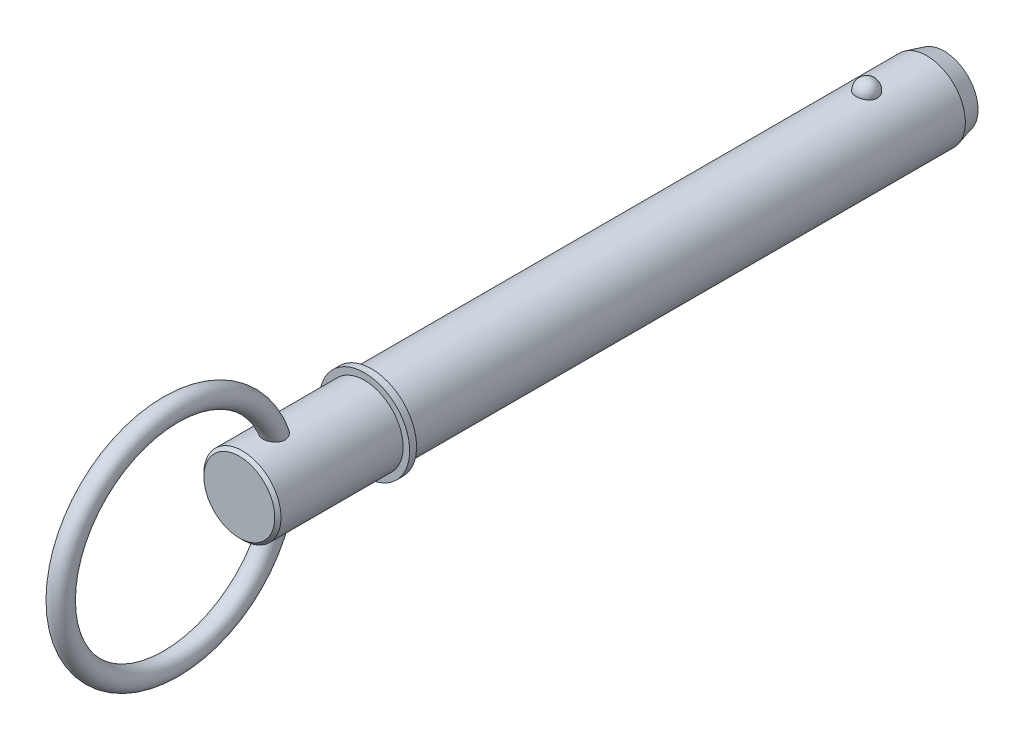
ISO-10303-21;
HEADER;
FILE_DESCRIPTION(('STEP AP214'),'2;1');
FILE_NAME('part.step','',(''),(''),'','','');
FILE_SCHEMA(('AUTOMOTIVE_DESIGN { 1 0 10303 214 1 1 1 1 }'));
ENDSEC;
DATA;
#1=APPLICATION_CONTEXT('core data for automotive mechanical design processes');
#2=APPLICATION_PROTOCOL_DEFINITION('international standard','automotive_design',2000,#1);
#3=PRODUCT_CONTEXT('',#1,'mechanical');
#4=PRODUCT('Part','Part','',(#3));
#5=PRODUCT_RELATED_PRODUCT_CATEGORY('part','',(#4));
#6=PRODUCT_DEFINITION_FORMATION('','',#4);
#7=PRODUCT_DEFINITION_CONTEXT('part definition',#1,'design');
#8=PRODUCT_DEFINITION('design','',#6,#7);
#9=PRODUCT_DEFINITION_SHAPE('','',#8);
#10=(LENGTH_UNIT() NAMED_UNIT(*) SI_UNIT(.MILLI.,.METRE.));
#11=(NAMED_UNIT(*) PLANE_ANGLE_UNIT() SI_UNIT($,.RADIAN.));
#12=(NAMED_UNIT(*) SI_UNIT($,.STERADIAN.) SOLID_ANGLE_UNIT());
#13=UNCERTAINTY_MEASURE_WITH_UNIT(LENGTH_MEASURE(1.E-05),#10,'distance_accuracy_value','');
#14=(GEOMETRIC_REPRESENTATION_CONTEXT(3) GLOBAL_UNCERTAINTY_ASSIGNED_CONTEXT((#13)) GLOBAL_UNIT_ASSIGNED_CONTEXT((#10,
#11,#12)) REPRESENTATION_CONTEXT('',''));
#15=CARTESIAN_POINT('',(0.,0.,0.));
#16=DIRECTION('',(0.,0.,1.));
#17=DIRECTION('',(1.,0.,0.));
#18=AXIS2_PLACEMENT_3D('',#15,#16,#17);
#19=CARTESIAN_POINT('',(0.,0.,139.7));
#20=DIRECTION('',(0.,0.,-1.));
#21=DIRECTION('',(-1.,0.,0.));
#22=AXIS2_PLACEMENT_3D('',#19,#20,#21);
#23=CYLINDRICAL_SURFACE('',#22,11.115);
#24=CARTESIAN_POINT('',(3.04058343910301,10.6910278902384,-3.07));
#25=CARTESIAN_POINT('',(3.04058039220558,10.6910304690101,-2.89837124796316));
#26=CARTESIAN_POINT('',(3.02657193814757,10.6950430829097,-2.72670368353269));
#27=CARTESIAN_POINT('',(2.97087341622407,10.7106465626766,-2.38822964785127));
#28=CARTESIAN_POINT('',(2.92917240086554,10.7222404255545,-2.22142512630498));
#29=CARTESIAN_POINT('',(2.81915317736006,10.751689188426,-1.89750816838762));
#30=CARTESIAN_POINT('',(2.75084669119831,10.7695413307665,-1.7403914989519));
#31=CARTESIAN_POINT('',(2.58932284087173,10.809510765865,-1.44013959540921));
#32=CARTESIAN_POINT('',(2.49610617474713,10.8316279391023,-1.29700396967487));
#33=CARTESIAN_POINT('',(2.28659317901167,10.877786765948,-1.02797591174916));
#34=CARTESIAN_POINT('',(2.17018825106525,10.9018371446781,-0.902169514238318));
#35=CARTESIAN_POINT('',(1.91759004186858,10.9490888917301,-0.672091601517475));
#36=CARTESIAN_POINT('',(1.78139672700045,10.9722902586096,-0.567820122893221));
#37=CARTESIAN_POINT('',(1.49327884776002,11.0151925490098,-0.383992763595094));
#38=CARTESIAN_POINT('',(1.34139928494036,11.034903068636,-0.30436866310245));
#39=CARTESIAN_POINT('',(1.02584823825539,11.0686948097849,-0.171731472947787));
#40=CARTESIAN_POINT('',(0.86217801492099,11.0827766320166,-0.118715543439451));
#41=CARTESIAN_POINT('',(0.530748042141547,11.1035404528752,-0.0415304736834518));
#42=CARTESIAN_POINT('',(0.363109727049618,11.1103474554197,-0.0168734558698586));
#43=CARTESIAN_POINT('',(0.0259327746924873,11.1162480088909,0.00453486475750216));
#44=CARTESIAN_POINT('',(-0.143605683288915,11.1153422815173,0.00128877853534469));
#45=CARTESIAN_POINT('',(-0.477280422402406,11.1059854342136,-0.0327676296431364));
#46=CARTESIAN_POINT('',(-0.641459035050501,11.0976393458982,-0.0631942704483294));
#47=CARTESIAN_POINT('',(-0.962236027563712,11.0744390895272,-0.150220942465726));
#48=CARTESIAN_POINT('',(-1.11883427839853,11.0595848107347,-0.20682141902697));
#49=CARTESIAN_POINT('',(-1.4210461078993,11.0248420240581,-0.345028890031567));
#50=CARTESIAN_POINT('',(-1.56659244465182,11.0049254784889,-0.426775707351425));
#51=CARTESIAN_POINT('',(-1.84189316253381,10.9622119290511,-0.612956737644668));
#52=CARTESIAN_POINT('',(-1.97164597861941,10.9394146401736,-0.71739319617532));
#53=CARTESIAN_POINT('',(-2.21432263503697,10.8929139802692,-0.948332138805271));
#54=CARTESIAN_POINT('',(-2.3268890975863,10.8692016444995,-1.07520847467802));
#55=CARTESIAN_POINT('',(-2.52940007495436,10.8238699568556,-1.34622145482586));
#56=CARTESIAN_POINT('',(-2.6193430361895,10.8022507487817,-1.49035928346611));
#57=CARTESIAN_POINT('',(-2.77523958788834,10.7632629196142,-1.79367507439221));
#58=CARTESIAN_POINT('',(-2.8409151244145,10.7459442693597,-1.95300253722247));
#59=CARTESIAN_POINT('',(-2.94519180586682,10.7178360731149,-2.28083009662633));
#60=CARTESIAN_POINT('',(-2.98379371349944,10.707046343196,-2.44932993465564));
#61=CARTESIAN_POINT('',(-3.03284665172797,10.6932559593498,-2.78998091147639));
#62=CARTESIAN_POINT('',(-3.04341313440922,10.6902233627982,-2.96211412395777));
#63=CARTESIAN_POINT('',(-3.03646037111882,10.6922002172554,-3.305762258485));
#64=CARTESIAN_POINT('',(-3.0189418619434,10.6972094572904,-3.47727719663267));
#65=CARTESIAN_POINT('',(-2.95641582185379,10.7146564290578,-3.81396465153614));
#66=CARTESIAN_POINT('',(-2.91154117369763,10.7270582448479,-3.97916375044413));
#67=CARTESIAN_POINT('',(-2.79553341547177,10.7578713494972,-4.29947360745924));
#68=CARTESIAN_POINT('',(-2.72439927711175,10.7762828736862,-4.45458397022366));
#69=CARTESIAN_POINT('',(-2.55718900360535,10.8171819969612,-4.75123550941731));
#70=CARTESIAN_POINT('',(-2.46098224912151,10.8396907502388,-4.89270014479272));
#71=CARTESIAN_POINT('',(-2.24623042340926,10.8862165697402,-5.15724095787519));
#72=CARTESIAN_POINT('',(-2.12768452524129,10.9102336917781,-5.28031645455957));
#73=CARTESIAN_POINT('',(-1.87085107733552,10.9571990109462,-5.5050961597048));
#74=CARTESIAN_POINT('',(-1.73249451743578,10.9801430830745,-5.60672245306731));
#75=CARTESIAN_POINT('',(-1.44010079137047,11.0223008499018,-5.78517789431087));
#76=CARTESIAN_POINT('',(-1.28606470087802,11.0415148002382,-5.86200874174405));
#77=CARTESIAN_POINT('',(-0.968615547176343,11.0738491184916,-5.98788441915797));
#78=CARTESIAN_POINT('',(-0.805339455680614,11.0870408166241,-6.03725610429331));
#79=CARTESIAN_POINT('',(-0.47244987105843,11.1062048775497,-6.10820004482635));
#80=CARTESIAN_POINT('',(-0.302837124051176,11.11217808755,-6.1297755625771));
#81=CARTESIAN_POINT('',(0.0345765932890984,11.1162034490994,-6.14436196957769));
#82=CARTESIAN_POINT('',(0.20235372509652,11.1143988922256,-6.13788957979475));
#83=CARTESIAN_POINT('',(0.534364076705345,11.103390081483,-6.09773981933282));
#84=CARTESIAN_POINT('',(0.698597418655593,11.094186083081,-6.06406338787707));
#85=CARTESIAN_POINT('',(1.01830314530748,11.0694136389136,-5.97063285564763));
#86=CARTESIAN_POINT('',(1.17380497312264,11.0538682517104,-5.91097318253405));
#87=CARTESIAN_POINT('',(1.472484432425,11.0180608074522,-5.76723645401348));
#88=CARTESIAN_POINT('',(1.6156613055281,10.9977984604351,-5.68315789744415));
#89=CARTESIAN_POINT('',(1.88801614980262,10.9543574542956,-5.49138807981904));
#90=CARTESIAN_POINT('',(2.01695079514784,10.9311394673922,-5.38336024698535));
#91=CARTESIAN_POINT('',(2.25501495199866,10.8845248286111,-5.14733839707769));
#92=CARTESIAN_POINT('',(2.36414099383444,10.8611281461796,-5.01934088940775));
#93=CARTESIAN_POINT('',(2.56152595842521,10.8162958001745,-4.74447932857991));
#94=CARTESIAN_POINT('',(2.64940088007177,10.7948999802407,-4.59733288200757));
#95=CARTESIAN_POINT('',(2.79961494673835,10.7569242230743,-4.29001203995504));
#96=CARTESIAN_POINT('',(2.86196390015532,10.7403424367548,-4.12984267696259));
#97=CARTESIAN_POINT('',(2.95377333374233,10.715429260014,-3.820623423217));
#98=CARTESIAN_POINT('',(2.98627018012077,10.7063495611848,-3.6725268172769));
#99=CARTESIAN_POINT('',(3.02967634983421,10.6941478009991,-3.37296350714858));
#100=CARTESIAN_POINT('',(3.04058612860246,10.6910256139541,-3.22149687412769));
#101=CARTESIAN_POINT('',(3.04058343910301,10.6910278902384,-3.07));
#102=B_SPLINE_CURVE_WITH_KNOTS('',3,(#24,#25,#26,#27,#28,#29,#30,#31,#32,#33,#34,#35,#36,#37,
#38,#39,#40,#41,#42,#43,#44,#45,#46,#47,#48,#49,#50,#51,#52,#53,#54,#55,#56,#57,#58,#59,#60,#61,
#62,#63,#64,#65,#66,#67,#68,#69,#70,#71,#72,#73,#74,#75,#76,#77,#78,#79,#80,#81,#82,#83,#84,#85,
#86,#87,#88,#89,#90,#91,#92,#93,#94,#95,#96,#97,#98,#99,#100,#101),.UNSPECIFIED.,.T.,.F.,(4,2,2,
2,2,2,2,2,2,2,2,2,2,2,2,2,2,2,2,2,2,2,2,2,2,2,2,2,2,2,2,2,2,2,2,2,2,2,4),(0.,0.514341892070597,
1.02888723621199,1.54320613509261,2.0575106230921,2.57428293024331,3.09105611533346,
3.60638589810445,4.1216606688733,4.62793159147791,5.1341551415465,5.63334381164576,
6.13254097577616,6.63456562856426,7.13663998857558,7.64804063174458,8.15947638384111,
8.6766026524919,9.19371435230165,9.70869321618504,10.223658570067,10.7361421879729,
11.2486458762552,11.7638748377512,12.2791228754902,12.7962115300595,13.3132647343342,
13.8240238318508,14.3347229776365,14.8360540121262,15.3373677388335,15.8368746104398,
16.3364121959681,16.8434736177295,17.3506237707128,17.8663484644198,18.3818748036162,
18.8358944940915,19.2899046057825),.UNSPECIFIED.);
#103=CARTESIAN_POINT('',(3.04058343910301,10.6910278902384,-3.07));
#104=VERTEX_POINT('',#103);
#105=EDGE_CURVE('E102',#104,#104,#102,.T.);
#106=ORIENTED_EDGE('',*,*,#105,.T.);
#107=EDGE_LOOP('',(#106));
#108=FACE_BOUND('',#107,.T.);
#109=CARTESIAN_POINT('',(0.,0.,-20.3999999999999));
#110=DIRECTION('',(0.,0.,-1.));
#111=DIRECTION('',(-1.,0.,0.));
#112=AXIS2_PLACEMENT_3D('',#109,#110,#111);
#113=CIRCLE('',#112,11.115);
#114=CARTESIAN_POINT('',(-11.115,0.,-20.3999999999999));
#115=VERTEX_POINT('',#114);
#116=EDGE_CURVE('E110',#115,#115,#113,.F.);
#117=ORIENTED_EDGE('',*,*,#116,.T.);
#118=EDGE_LOOP('',(#117));
#119=FACE_BOUND('',#118,.T.);
#120=CARTESIAN_POINT('',(0.,0.,139.7));
#121=DIRECTION('',(0.,0.,1.));
#122=DIRECTION('',(1.,0.,0.));
#123=AXIS2_PLACEMENT_3D('',#120,#121,#122);
#124=CIRCLE('',#123,11.115);
#125=CARTESIAN_POINT('',(11.115,0.,139.7));
#126=VERTEX_POINT('',#125);
#127=EDGE_CURVE('E108',#126,#126,#124,.T.);
#128=ORIENTED_EDGE('',*,*,#127,.F.);
#129=EDGE_LOOP('',(#128));
#130=FACE_BOUND('',#129,.T.);
#131=ADVANCED_FACE('F39',(#108,#119,#130),#23,.T.);
#132=CARTESIAN_POINT('',(0.,0.,-25.4));
#133=DIRECTION('',(0.,0.,-1.));
#134=DIRECTION('',(-1.,0.,0.));
#135=AXIS2_PLACEMENT_3D('',#132,#133,#134);
#136=PLANE('',#135);
#137=CARTESIAN_POINT('',(0.,0.,-25.4));
#138=DIRECTION('',(0.,0.,-1.));
#139=DIRECTION('',(-1.,0.,0.));
#140=AXIS2_PLACEMENT_3D('',#137,#138,#139);
#141=CIRCLE('',#140,9.77525403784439);
#142=CARTESIAN_POINT('',(-9.77525403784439,0.,-25.4));
#143=VERTEX_POINT('',#142);
#144=EDGE_CURVE('E141',#143,#143,#141,.T.);
#145=ORIENTED_EDGE('',*,*,#144,.T.);
#146=EDGE_LOOP('',(#145));
#147=FACE_BOUND('',#146,.T.);
#148=ADVANCED_FACE('F88',(#147),#136,.T.);
#149=CARTESIAN_POINT('',(0.,0.,-25.4));
#150=DIRECTION('',(0.,0.,1.));
#151=DIRECTION('',(1.,0.,0.));
#152=AXIS2_PLACEMENT_3D('',#149,#150,#151);
#153=CONICAL_SURFACE('',#152,9.77525403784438,0.261799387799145);
#154=ORIENTED_EDGE('',*,*,#116,.F.);
#155=EDGE_LOOP('',(#154));
#156=FACE_BOUND('',#155,.T.);
#157=ORIENTED_EDGE('',*,*,#144,.F.);
#158=EDGE_LOOP('',(#157));
#159=FACE_BOUND('',#158,.T.);
#160=ADVANCED_FACE('F94',(#156,#159),#153,.T.);
#161=CARTESIAN_POINT('',(0.,11.115,-3.07));
#162=DIRECTION('',(0.,1.,0.));
#163=DIRECTION('',(0.,0.,1.));
#164=AXIS2_PLACEMENT_3D('',#161,#162,#163);
#165=SPHERICAL_SURFACE('',#164,3.07);
#166=ORIENTED_EDGE('',*,*,#105,.F.);
#167=EDGE_LOOP('',(#166));
#168=FACE_BOUND('',#167,.T.);
#169=ADVANCED_FACE('F113',(#168),#165,.T.);
#170=CARTESIAN_POINT('',(0.,0.,139.7));
#171=DIRECTION('',(0.,0.,-1.));
#172=DIRECTION('',(-1.,0.,0.));
#173=AXIS2_PLACEMENT_3D('',#170,#171,#172);
#174=PLANE('',#173);
#175=ORIENTED_EDGE('',*,*,#127,.T.);
#176=EDGE_LOOP('',(#175));
#177=FACE_BOUND('',#176,.T.);
#178=CARTESIAN_POINT('',(0.,0.,139.7));
#179=DIRECTION('',(0.,0.,-1.));
#180=DIRECTION('',(-1.,0.,0.));
#181=AXIS2_PLACEMENT_3D('',#178,#179,#180);
#182=CIRCLE('',#181,13.);
#183=CARTESIAN_POINT('',(-13.,0.,139.7));
#184=VERTEX_POINT('',#183);
#185=EDGE_CURVE('E109',#184,#184,#182,.T.);
#186=ORIENTED_EDGE('',*,*,#185,.T.);
#187=EDGE_LOOP('',(#186));
#188=FACE_BOUND('',#187,.T.);
#189=ADVANCED_FACE('F117',(#177,#188),#174,.T.);
#190=CARTESIAN_POINT('',(0.,0.,33.7287874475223));
#191=DIRECTION('',(0.,0.,-1.));
#192=DIRECTION('',(-1.,0.,0.));
#193=AXIS2_PLACEMENT_3D('',#190,#191,#192);
#194=CYLINDRICAL_SURFACE('',#193,13.);
#195=CARTESIAN_POINT('',(0.,0.,141.7));
#196=DIRECTION('',(0.,0.,-1.));
#197=DIRECTION('',(-1.,0.,0.));
#198=AXIS2_PLACEMENT_3D('',#195,#196,#197);
#199=CIRCLE('',#198,13.);
#200=CARTESIAN_POINT('',(-13.,0.,141.7));
#201=VERTEX_POINT('',#200);
#202=EDGE_CURVE('E134',#201,#201,#199,.T.);
#203=ORIENTED_EDGE('',*,*,#202,.T.);
#204=EDGE_LOOP('',(#203));
#205=FACE_BOUND('',#204,.T.);
#206=ORIENTED_EDGE('',*,*,#185,.F.);
#207=EDGE_LOOP('',(#206));
#208=FACE_BOUND('',#207,.T.);
#209=ADVANCED_FACE('F121',(#205,#208),#194,.T.);
#210=CARTESIAN_POINT('',(0.,13.,141.7));
#211=DIRECTION('',(0.,0.,1.));
#212=DIRECTION('',(1.,0.,0.));
#213=AXIS2_PLACEMENT_3D('',#210,#211,#212);
#214=PLANE('',#213);
#215=CARTESIAN_POINT('',(0.,0.,141.7));
#216=DIRECTION('',(0.,0.,1.));
#217=DIRECTION('',(1.,0.,0.));
#218=AXIS2_PLACEMENT_3D('',#215,#216,#217);
#219=CIRCLE('',#218,11.115);
#220=CARTESIAN_POINT('',(11.115,0.,141.7));
#221=VERTEX_POINT('',#220);
#222=EDGE_CURVE('E112',#221,#221,#219,.T.);
#223=ORIENTED_EDGE('',*,*,#222,.F.);
#224=EDGE_LOOP('',(#223));
#225=FACE_BOUND('',#224,.T.);
#226=ORIENTED_EDGE('',*,*,#202,.F.);
#227=EDGE_LOOP('',(#226));
#228=FACE_BOUND('',#227,.T.);
#229=ADVANCED_FACE('F85',(#225,#228),#214,.T.);
#230=CARTESIAN_POINT('',(0.,0.,177.8));
#231=DIRECTION('',(0.,0.,-1.));
#232=DIRECTION('',(-1.,0.,0.));
#233=AXIS2_PLACEMENT_3D('',#230,#231,#232);
#234=CYLINDRICAL_SURFACE('',#233,11.115);
#235=CARTESIAN_POINT('',(-1.22435852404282,-11.0473603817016,164.878419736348));
#236=CARTESIAN_POINT('',(-1.0707801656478,-11.0643805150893,164.811699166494));
#237=CARTESIAN_POINT('',(-0.911372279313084,-11.0787777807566,164.757745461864));
#238=CARTESIAN_POINT('',(-0.585451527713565,-11.1007717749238,164.676552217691));
#239=CARTESIAN_POINT('',(-0.418938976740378,-11.1083688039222,164.649311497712));
#240=CARTESIAN_POINT('',(-0.0835394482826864,-11.1159515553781,164.622121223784));
#241=CARTESIAN_POINT('',(0.0853474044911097,-11.1159376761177,164.622170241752));
#242=CARTESIAN_POINT('',(0.420723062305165,-11.1083011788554,164.649554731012));
#243=CARTESIAN_POINT('',(0.58721183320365,-11.1006784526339,164.676890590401));
#244=CARTESIAN_POINT('',(0.913189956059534,-11.0786293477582,164.75829957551));
#245=CARTESIAN_POINT('',(1.07267378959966,-11.0641977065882,164.812393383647));
#246=CARTESIAN_POINT('',(1.3799404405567,-11.0300907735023,164.946140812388));
#247=CARTESIAN_POINT('',(1.52772335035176,-11.0104155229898,165.025794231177));
#248=CARTESIAN_POINT('',(1.80679367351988,-10.9680716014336,165.208467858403));
#249=CARTESIAN_POINT('',(1.93814041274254,-10.945414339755,165.311400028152));
#250=CARTESIAN_POINT('',(2.18117403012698,-10.8995884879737,165.538212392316));
#251=CARTESIAN_POINT('',(2.29286356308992,-10.8764199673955,165.662089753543));
#252=CARTESIAN_POINT('',(2.49238969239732,-10.8324319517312,165.925992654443));
#253=CARTESIAN_POINT('',(2.58046870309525,-10.8115899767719,166.065831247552));
#254=CARTESIAN_POINT('',(2.73218762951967,-10.7742522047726,166.358691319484));
#255=CARTESIAN_POINT('',(2.7958294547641,-10.757756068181,166.511711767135));
#256=CARTESIAN_POINT('',(2.89767977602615,-10.7307723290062,166.8266092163));
#257=CARTESIAN_POINT('',(2.93586554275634,-10.7202900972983,166.988493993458));
#258=CARTESIAN_POINT('',(2.98678800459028,-10.7062139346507,167.316480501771));
#259=CARTESIAN_POINT('',(2.99951894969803,-10.7026215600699,167.482583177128));
#260=CARTESIAN_POINT('',(3.0004780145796,-10.7023530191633,167.823227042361));
#261=CARTESIAN_POINT('',(2.98743421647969,-10.7060358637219,167.997770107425));
#262=CARTESIAN_POINT('',(2.93592917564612,-10.7202719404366,168.342750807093));
#263=CARTESIAN_POINT('',(2.8974582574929,-10.7308277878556,168.513186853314));
#264=CARTESIAN_POINT('',(2.79180512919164,-10.7588257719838,168.863114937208));
#265=CARTESIAN_POINT('',(2.72213928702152,-10.776850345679,169.041811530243));
#266=CARTESIAN_POINT('',(2.5561284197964,-10.8174264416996,169.385974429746));
#267=CARTESIAN_POINT('',(2.4597569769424,-10.8399824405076,169.551427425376));
#268=CARTESIAN_POINT('',(2.23434632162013,-10.8887625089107,169.875672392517));
#269=CARTESIAN_POINT('',(2.10349593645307,-10.9151327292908,170.033192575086));
#270=CARTESIAN_POINT('',(1.81505097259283,-10.96677510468,170.321668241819));
#271=CARTESIAN_POINT('',(1.65749731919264,-10.9920488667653,170.45266371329));
#272=CARTESIAN_POINT('',(1.36197799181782,-11.0319737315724,170.651313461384));
#273=CARTESIAN_POINT('',(1.22927684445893,-11.0476896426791,170.72660092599));
#274=CARTESIAN_POINT('',(0.952979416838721,-11.0749380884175,170.854574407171));
#275=CARTESIAN_POINT('',(0.809393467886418,-11.0864745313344,170.90728154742));
#276=CARTESIAN_POINT('',(0.513954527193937,-11.1041011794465,170.987058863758));
#277=CARTESIAN_POINT('',(0.362058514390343,-11.1101594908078,171.013978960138));
#278=CARTESIAN_POINT('',(0.0557792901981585,-11.1159132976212,171.039559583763));
#279=CARTESIAN_POINT('',(-0.0986030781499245,-11.1156109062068,171.038229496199));
#280=CARTESIAN_POINT('',(-0.389768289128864,-11.1090283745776,171.008935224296));
#281=CARTESIAN_POINT('',(-0.526830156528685,-11.1033186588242,170.983512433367));
#282=CARTESIAN_POINT('',(-0.794878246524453,-11.0873547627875,170.911270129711));
#283=CARTESIAN_POINT('',(-0.925863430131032,-11.0770998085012,170.864446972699));
#284=CARTESIAN_POINT('',(-1.18354406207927,-11.0525934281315,170.749843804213));
#285=CARTESIAN_POINT('',(-1.30991621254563,-11.0382116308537,170.681371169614));
#286=CARTESIAN_POINT('',(-1.55122352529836,-11.0068962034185,170.527131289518));
#287=CARTESIAN_POINT('',(-1.66615377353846,-10.9899614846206,170.441356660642));
#288=CARTESIAN_POINT('',(-1.90024050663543,-10.9520991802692,170.24087205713));
#289=CARTESIAN_POINT('',(-2.01728342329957,-10.9309598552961,170.123737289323));
#290=CARTESIAN_POINT('',(-2.23333659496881,-10.8888735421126,169.873839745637));
#291=CARTESIAN_POINT('',(-2.33233396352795,-10.8679267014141,169.741065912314));
#292=CARTESIAN_POINT('',(-2.52607041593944,-10.8246766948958,169.440000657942));
#293=CARTESIAN_POINT('',(-2.61741570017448,-10.8027194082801,169.269462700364));
#294=CARTESIAN_POINT('',(-2.77251687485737,-10.7639568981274,168.915671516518));
#295=CARTESIAN_POINT('',(-2.83625783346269,-10.7471544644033,168.732411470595));
#296=CARTESIAN_POINT('',(-2.93668505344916,-10.7201706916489,168.346624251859));
#297=CARTESIAN_POINT('',(-2.97161961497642,-10.7104219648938,168.143594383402));
#298=CARTESIAN_POINT('',(-2.99683495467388,-10.7033740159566,167.836874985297));
#299=CARTESIAN_POINT('',(-3.00070536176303,-10.7022882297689,167.734234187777));
#300=CARTESIAN_POINT('',(-2.99908594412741,-10.7027439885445,167.529049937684));
#301=CARTESIAN_POINT('',(-2.99360154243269,-10.7042840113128,167.426506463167));
#302=CARTESIAN_POINT('',(-2.97382504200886,-10.7097936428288,167.230330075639));
#303=CARTESIAN_POINT('',(-2.9602439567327,-10.7135669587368,167.136619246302));
#304=CARTESIAN_POINT('',(-2.92480741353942,-10.723295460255,166.950932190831));
#305=CARTESIAN_POINT('',(-2.90295619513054,-10.7292495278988,166.85895510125));
#306=CARTESIAN_POINT('',(-2.85097003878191,-10.7431800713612,166.677547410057));
#307=CARTESIAN_POINT('',(-2.82083748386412,-10.7511559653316,166.588116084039));
#308=CARTESIAN_POINT('',(-2.75241691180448,-10.7688750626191,166.41264532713));
#309=CARTESIAN_POINT('',(-2.71412954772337,-10.7786181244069,166.32660562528));
#310=CARTESIAN_POINT('',(-2.59550576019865,-10.807996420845,166.091055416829));
#311=CARTESIAN_POINT('',(-2.50612224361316,-10.8292837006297,165.946173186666));
#312=CARTESIAN_POINT('',(-2.30366035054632,-10.8741467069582,165.674571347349));
#313=CARTESIAN_POINT('',(-2.19058370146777,-10.8977222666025,165.547850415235));
#314=CARTESIAN_POINT('',(-1.94442412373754,-10.9443154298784,165.316462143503));
#315=CARTESIAN_POINT('',(-1.81141354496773,-10.967334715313,165.21171820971));
#316=CARTESIAN_POINT('',(-1.52904284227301,-11.0102504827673,165.026435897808));
#317=CARTESIAN_POINT('',(-1.37968206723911,-11.0301468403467,164.945898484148));
#318=CARTESIAN_POINT('',(-1.22435852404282,-11.0473603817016,164.878419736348));
#319=B_SPLINE_CURVE_WITH_KNOTS('',3,(#235,#236,#237,#238,#239,#240,#241,#242,#243,#244,#245,
#246,#247,#248,#249,#250,#251,#252,#253,#254,#255,#256,#257,#258,#259,#260,#261,#262,#263,#264,
#265,#266,#267,#268,#269,#270,#271,#272,#273,#274,#275,#276,#277,#278,#279,#280,#281,#282,#283,
#284,#285,#286,#287,#288,#289,#290,#291,#292,#293,#294,#295,#296,#297,#298,#299,#300,#301,#302,
#303,#304,#305,#306,#307,#308,#309,#310,#311,#312,#313,#314,#315,#316,#317,#318),.UNSPECIFIED.,
.T.,.F.,(4,2,2,2,2,2,2,2,2,2,2,2,2,2,2,2,2,2,2,2,2,2,2,2,2,2,2,2,2,2,2,2,2,2,2,2,2,2,2,2,2,4),
(0.,0.504317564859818,1.00861284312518,1.51288173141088,2.01715779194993,2.52182424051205,
3.02648670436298,3.52927157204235,4.03198848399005,4.52932690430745,5.02662645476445,
5.5243694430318,6.02222485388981,6.545261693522,7.06849767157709,7.64398785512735,
8.22004937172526,8.83633461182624,9.45168373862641,9.90997173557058,10.3678300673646,
10.8283372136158,11.2886913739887,11.7053264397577,12.1220324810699,12.5537129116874,
12.9855779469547,13.4844842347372,13.9837454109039,14.5653303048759,15.1472294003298,
15.762338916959,16.0701226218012,16.3777279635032,16.6616380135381,16.9454027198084,
17.229085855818,17.5127462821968,18.0246262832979,18.5364689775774,19.0464970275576,
19.5565453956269),.UNSPECIFIED.);
#320=CARTESIAN_POINT('',(-1.22435852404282,-11.0473603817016,164.878419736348));
#321=VERTEX_POINT('',#320);
#322=EDGE_CURVE('E10',#321,#321,#319,.T.);
#323=ORIENTED_EDGE('',*,*,#322,.F.);
#324=EDGE_LOOP('',(#323));
#325=FACE_BOUND('',#324,.T.);
#326=CARTESIAN_POINT('',(-1.22435852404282,11.0473603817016,164.878419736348));
#327=CARTESIAN_POINT('',(-1.3763077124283,11.0305212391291,164.944431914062));
#328=CARTESIAN_POINT('',(-1.5225432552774,11.0111158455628,165.022938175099));
#329=CARTESIAN_POINT('',(-1.79945383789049,10.9692671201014,165.20315338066));
#330=CARTESIAN_POINT('',(-1.9301301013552,10.9468240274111,165.304860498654));
#331=CARTESIAN_POINT('',(-2.17227655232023,10.9013603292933,165.529035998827));
#332=CARTESIAN_POINT('',(-2.28373752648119,10.8783394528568,165.651514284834));
#333=CARTESIAN_POINT('',(-2.4842745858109,10.8343057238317,165.913895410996));
#334=CARTESIAN_POINT('',(-2.57335330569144,10.8132926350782,166.053796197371));
#335=CARTESIAN_POINT('',(-2.72640074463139,10.7757209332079,166.345964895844));
#336=CARTESIAN_POINT('',(-2.79054231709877,10.7591319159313,166.49813851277));
#337=CARTESIAN_POINT('',(-2.89354234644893,10.7318913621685,166.811286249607));
#338=CARTESIAN_POINT('',(-2.932399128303,10.7212402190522,166.972260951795));
#339=CARTESIAN_POINT('',(-2.98540436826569,10.7066038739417,167.301955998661));
#340=CARTESIAN_POINT('',(-2.99901659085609,10.7027634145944,167.470768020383));
#341=CARTESIAN_POINT('',(-3.0008814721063,10.7022388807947,167.808508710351));
#342=CARTESIAN_POINT('',(-2.98912652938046,10.7055569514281,167.977437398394));
#343=CARTESIAN_POINT('',(-2.93985175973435,10.7191979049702,168.324856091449));
#344=CARTESIAN_POINT('',(-2.90036626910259,10.7300544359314,168.503044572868));
#345=CARTESIAN_POINT('',(-2.7955500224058,10.7578360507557,168.851215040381));
#346=CARTESIAN_POINT('',(-2.73019988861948,10.774765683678,169.021190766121));
#347=CARTESIAN_POINT('',(-2.56762574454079,10.8147227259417,169.365784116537));
#348=CARTESIAN_POINT('',(-2.46786230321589,10.838191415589,169.539157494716));
#349=CARTESIAN_POINT('',(-2.24100420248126,10.8873575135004,169.866686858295));
#350=CARTESIAN_POINT('',(-2.11391925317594,10.9130541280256,170.020849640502));
#351=CARTESIAN_POINT('',(-1.85542700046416,10.9597063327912,170.282735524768));
#352=CARTESIAN_POINT('',(-1.72758345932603,10.9807909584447,170.393955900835));
#353=CARTESIAN_POINT('',(-1.45489931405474,11.0202250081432,170.59412236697));
#354=CARTESIAN_POINT('',(-1.31006770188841,11.0385758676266,170.683080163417));
#355=CARTESIAN_POINT('',(-1.08171164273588,11.0625084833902,170.7963702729));
#356=CARTESIAN_POINT('',(-1.00332234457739,11.069914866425,170.830896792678));
#357=CARTESIAN_POINT('',(-0.843525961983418,11.0832350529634,170.892391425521));
#358=CARTESIAN_POINT('',(-0.762120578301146,11.0891496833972,170.919363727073));
#359=CARTESIAN_POINT('',(-0.597014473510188,11.0992628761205,170.96518193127));
#360=CARTESIAN_POINT('',(-0.513315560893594,11.1034627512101,170.984034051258));
#361=CARTESIAN_POINT('',(-0.344374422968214,11.1099851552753,171.013209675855));
#362=CARTESIAN_POINT('',(-0.259132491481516,11.1123080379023,171.023534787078));
#363=CARTESIAN_POINT('',(-0.100838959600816,11.114780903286,171.034519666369));
#364=CARTESIAN_POINT('',(-0.027873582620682,11.1152042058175,171.036395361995));
#365=CARTESIAN_POINT('',(0.117962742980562,11.1146132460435,171.033773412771));
#366=CARTESIAN_POINT('',(0.190833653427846,11.1135985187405,171.029273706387));
#367=CARTESIAN_POINT('',(0.335842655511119,11.110161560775,171.013978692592));
#368=CARTESIAN_POINT('',(0.407981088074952,11.1077400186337,171.003186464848));
#369=CARTESIAN_POINT('',(0.551029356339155,11.1015643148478,170.975503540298));
#370=CARTESIAN_POINT('',(0.621938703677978,11.0978096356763,170.958610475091));
#371=CARTESIAN_POINT('',(0.82538178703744,11.0851145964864,170.901054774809));
#372=CARTESIAN_POINT('',(0.955713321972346,11.0745538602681,170.852705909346));
#373=CARTESIAN_POINT('',(1.20733127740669,11.0499605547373,170.737325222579));
#374=CARTESIAN_POINT('',(1.32861527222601,11.0359270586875,170.670288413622));
#375=CARTESIAN_POINT('',(1.57344360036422,11.0038352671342,170.511843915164));
#376=CARTESIAN_POINT('',(1.69572941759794,10.9855025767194,170.418551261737));
#377=CARTESIAN_POINT('',(1.92565215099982,10.9475431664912,170.215650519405));
#378=CARTESIAN_POINT('',(2.0332801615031,10.9279156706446,170.106032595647));
#379=CARTESIAN_POINT('',(2.25048911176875,10.8854412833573,169.85299112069));
#380=CARTESIAN_POINT('',(2.35710396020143,10.8626332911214,169.707010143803));
#381=CARTESIAN_POINT('',(2.5475731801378,10.8195493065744,169.400478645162));
#382=CARTESIAN_POINT('',(2.63141052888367,10.799275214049,169.239917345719));
#383=CARTESIAN_POINT('',(2.78342312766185,10.7611645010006,168.887827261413));
#384=CARTESIAN_POINT('',(2.84851472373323,10.7439117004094,168.694893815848));
#385=CARTESIAN_POINT('',(2.9456265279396,10.7177011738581,168.300130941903));
#386=CARTESIAN_POINT('',(2.97764942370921,10.7087427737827,168.09830223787));
#387=CARTESIAN_POINT('',(2.99864828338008,10.7028651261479,167.795989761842));
#388=CARTESIAN_POINT('',(3.00125529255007,10.7021342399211,167.696378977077));
#389=CARTESIAN_POINT('',(2.9976304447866,10.7031517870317,167.497345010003));
#390=CARTESIAN_POINT('',(2.99140295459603,10.704898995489,167.397921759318));
#391=CARTESIAN_POINT('',(2.96990080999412,10.710883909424,167.200179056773));
#392=CARTESIAN_POINT('',(2.95463019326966,10.7151205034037,167.101859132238));
#393=CARTESIAN_POINT('',(2.91493260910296,10.7259879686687,166.907219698));
#394=CARTESIAN_POINT('',(2.89050674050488,10.7326185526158,166.810899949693));
#395=CARTESIAN_POINT('',(2.83556656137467,10.7472556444,166.631222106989));
#396=CARTESIAN_POINT('',(2.80596337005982,10.7550439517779,166.547566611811));
#397=CARTESIAN_POINT('',(2.73953102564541,10.7721572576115,166.383300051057));
#398=CARTESIAN_POINT('',(2.7026993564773,10.7814827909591,166.302690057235));
#399=CARTESIAN_POINT('',(2.6220344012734,10.801383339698,166.145273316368));
#400=CARTESIAN_POINT('',(2.57820565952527,10.8119575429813,166.068464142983));
#401=CARTESIAN_POINT('',(2.48382482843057,10.8340293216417,165.919223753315));
#402=CARTESIAN_POINT('',(2.4332703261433,10.8455272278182,165.846794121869));
#403=CARTESIAN_POINT('',(2.27895739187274,10.879345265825,165.645992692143));
#404=CARTESIAN_POINT('',(2.16717186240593,10.9023791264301,165.523764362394));
#405=CARTESIAN_POINT('',(1.92442677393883,10.9478318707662,165.300151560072));
#406=CARTESIAN_POINT('',(1.79346836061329,10.9702507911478,165.198765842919));
#407=CARTESIAN_POINT('',(1.51657151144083,11.0119360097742,165.019564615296));
#408=CARTESIAN_POINT('',(1.37069187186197,11.0312139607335,164.941661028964));
#409=CARTESIAN_POINT('',(1.0676440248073,11.0646548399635,164.810680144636));
#410=CARTESIAN_POINT('',(0.910475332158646,11.0788175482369,164.757603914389));
#411=CARTESIAN_POINT('',(0.587492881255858,11.1006548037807,164.67697871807));
#412=CARTESIAN_POINT('',(0.421604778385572,11.1082585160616,164.649708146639));
#413=CARTESIAN_POINT('',(0.0874262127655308,11.1159127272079,164.622259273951));
#414=CARTESIAN_POINT('',(-0.080864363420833,11.1159628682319,164.62208225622));
#415=CARTESIAN_POINT('',(-0.416252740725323,11.1084780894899,164.648918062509));
#416=CARTESIAN_POINT('',(-0.583334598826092,11.1008914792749,164.676116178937));
#417=CARTESIAN_POINT('',(-0.910355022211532,11.0788693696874,164.757401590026));
#418=CARTESIAN_POINT('',(-1.07029370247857,11.064433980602,164.811488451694));
#419=CARTESIAN_POINT('',(-1.22435852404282,11.0473603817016,164.878419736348));
#420=B_SPLINE_CURVE_WITH_KNOTS('',3,(#326,#327,#328,#329,#330,#331,#332,#333,#334,#335,#336,
#337,#338,#339,#340,#341,#342,#343,#344,#345,#346,#347,#348,#349,#350,#351,#352,#353,#354,#355,
#356,#357,#358,#359,#360,#361,#362,#363,#364,#365,#366,#367,#368,#369,#370,#371,#372,#373,#374,
#375,#376,#377,#378,#379,#380,#381,#382,#383,#384,#385,#386,#387,#388,#389,#390,#391,#392,#393,
#394,#395,#396,#397,#398,#399,#400,#401,#402,#403,#404,#405,#406,#407,#408,#409,#410,#411,#412,
#413,#414,#415,#416,#417,#418,#419),.UNSPECIFIED.,.T.,.F.,(4,2,2,2,2,2,2,2,2,2,2,2,2,2,2,2,2,2,
2,2,2,2,2,2,2,2,2,2,2,2,2,2,2,2,2,2,2,2,2,2,2,2,2,2,2,2,4),(0.,0.4989776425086,
0.997916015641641,1.4970929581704,1.99621111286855,2.49180514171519,2.98743199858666,
3.49347125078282,3.99966216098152,4.54591839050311,5.09258465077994,5.69407889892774,
6.29535972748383,6.80565832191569,7.31568801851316,7.57328514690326,7.83073916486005,
8.08799570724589,8.34520376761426,8.56389164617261,8.78265025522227,9.00130188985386,
9.22003849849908,9.63638938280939,10.0528514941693,10.5157946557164,10.9790178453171,
11.5234572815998,12.0683024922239,12.6784825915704,13.288613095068,13.5872082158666,
13.8856557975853,14.1839702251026,14.482248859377,14.7491407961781,15.016125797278,
15.2829381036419,15.5498463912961,16.0489312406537,16.5479862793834,17.0451454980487,
17.542326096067,18.0448111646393,18.5473200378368,19.0532532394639,19.5591782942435),.UNSPECIFIED.);
#421=CARTESIAN_POINT('',(-1.22435852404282,11.0473603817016,164.878419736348));
#422=VERTEX_POINT('',#421);
#423=EDGE_CURVE('E51',#422,#422,#420,.T.);
#424=ORIENTED_EDGE('',*,*,#423,.F.);
#425=EDGE_LOOP('',(#424));
#426=FACE_BOUND('',#425,.T.);
#427=CARTESIAN_POINT('',(0.,0.,176.9));
#428=DIRECTION('',(0.,0.,-1.));
#429=DIRECTION('',(-1.,0.,0.));
#430=AXIS2_PLACEMENT_3D('',#427,#428,#429);
#431=CIRCLE('',#430,11.115);
#432=CARTESIAN_POINT('',(-11.115,0.,176.9));
#433=VERTEX_POINT('',#432);
#434=EDGE_CURVE('E64',#433,#433,#431,.T.);
#435=ORIENTED_EDGE('',*,*,#434,.T.);
#436=EDGE_LOOP('',(#435));
#437=FACE_BOUND('',#436,.T.);
#438=ORIENTED_EDGE('',*,*,#222,.T.);
#439=EDGE_LOOP('',(#438));
#440=FACE_BOUND('',#439,.T.);
#441=ADVANCED_FACE('F69',(#325,#426,#437,#440),#234,.T.);
#442=CARTESIAN_POINT('',(0.,0.,177.8));
#443=DIRECTION('',(0.,0.,-1.));
#444=DIRECTION('',(-1.,0.,0.));
#445=AXIS2_PLACEMENT_3D('',#442,#443,#444);
#446=PLANE('',#445);
#447=CARTESIAN_POINT('',(0.,0.,177.8));
#448=DIRECTION('',(0.,0.,-1.));
#449=DIRECTION('',(-1.,0.,0.));
#450=AXIS2_PLACEMENT_3D('',#447,#448,#449);
#451=CIRCLE('',#450,10.2149999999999);
#452=CARTESIAN_POINT('',(-10.2149999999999,0.,177.8));
#453=VERTEX_POINT('',#452);
#454=EDGE_CURVE('E58',#453,#453,#451,.F.);
#455=ORIENTED_EDGE('',*,*,#454,.T.);
#456=EDGE_LOOP('',(#455));
#457=FACE_BOUND('',#456,.T.);
#458=ADVANCED_FACE('F76',(#457),#446,.F.);
#459=CARTESIAN_POINT('',(0.,0.,176.9));
#460=DIRECTION('',(0.,0.,-1.));
#461=DIRECTION('',(-1.,0.,0.));
#462=AXIS2_PLACEMENT_3D('',#459,#460,#461);
#463=CONICAL_SURFACE('',#462,11.115,0.785398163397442);
#464=ORIENTED_EDGE('',*,*,#454,.F.);
#465=EDGE_LOOP('',(#464));
#466=FACE_BOUND('',#465,.T.);
#467=ORIENTED_EDGE('',*,*,#434,.F.);
#468=EDGE_LOOP('',(#467));
#469=FACE_BOUND('',#468,.T.);
#470=ADVANCED_FACE('F41',(#466,#469),#463,.T.);
#471=CARTESIAN_POINT('',(0.,0.,197.55));
#472=DIRECTION('',(1.,0.,0.));
#473=DIRECTION('',(0.,0.,-1.));
#474=AXIS2_PLACEMENT_3D('',#471,#472,#473);
#475=TOROIDAL_SURFACE('',#474,31.75,3.);
#476=ORIENTED_EDGE('',*,*,#322,.T.);
#477=EDGE_LOOP('',(#476));
#478=FACE_BOUND('',#477,.T.);
#479=ORIENTED_EDGE('',*,*,#423,.T.);
#480=EDGE_LOOP('',(#479));
#481=FACE_BOUND('',#480,.T.);
#482=ADVANCED_FACE('F73',(#478,#481),#475,.T.);
#483=CLOSED_SHELL('',(#131,#148,#160,#169,#189,#209,#229,#441,#458,#470,#482));
#484=MANIFOLD_SOLID_BREP('B2',#483);
#485=ADVANCED_BREP_SHAPE_REPRESENTATION('',(#18,#484),#14);
#486=SHAPE_DEFINITION_REPRESENTATION(#9,#485);
ENDSEC;
END-ISO-10303-21;
